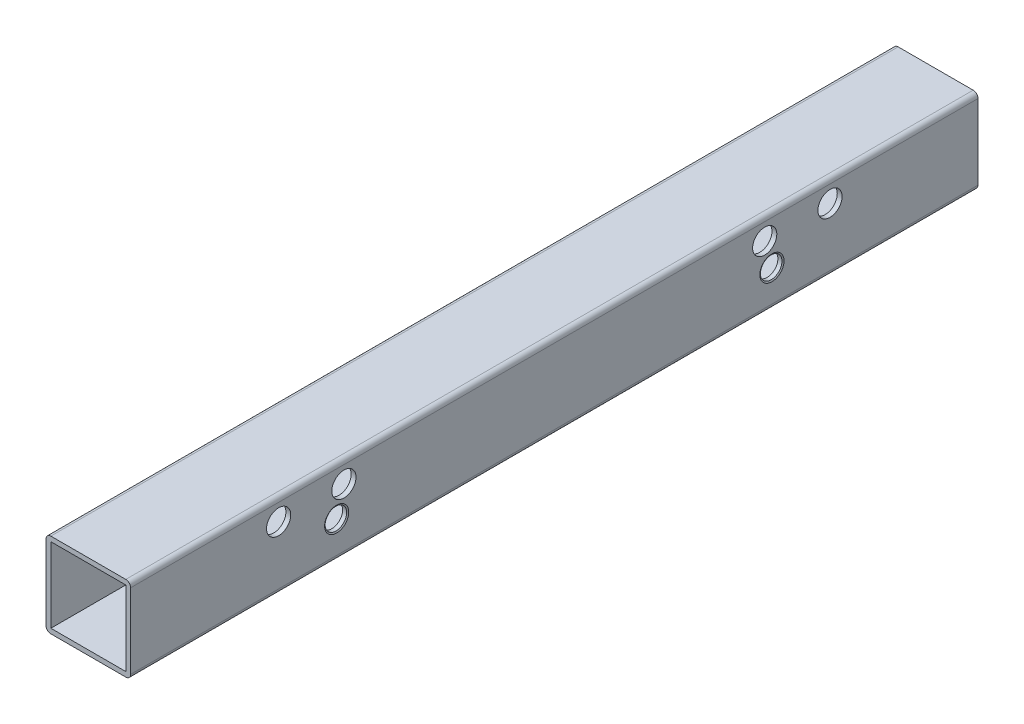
ISO-10303-21;
HEADER;
FILE_DESCRIPTION(('STEP AP214'),'2;1');
FILE_NAME('part.step','',(''),(''),'','','');
FILE_SCHEMA(('AUTOMOTIVE_DESIGN { 1 0 10303 214 1 1 1 1 }'));
ENDSEC;
DATA;
#1=APPLICATION_CONTEXT('core data for automotive mechanical design processes');
#2=APPLICATION_PROTOCOL_DEFINITION('international standard','automotive_design',2000,#1);
#3=PRODUCT_CONTEXT('',#1,'mechanical');
#4=PRODUCT('Part','Part','',(#3));
#5=PRODUCT_RELATED_PRODUCT_CATEGORY('part','',(#4));
#6=PRODUCT_DEFINITION_FORMATION('','',#4);
#7=PRODUCT_DEFINITION_CONTEXT('part definition',#1,'design');
#8=PRODUCT_DEFINITION('design','',#6,#7);
#9=PRODUCT_DEFINITION_SHAPE('','',#8);
#10=(LENGTH_UNIT() NAMED_UNIT(*) SI_UNIT(.MILLI.,.METRE.));
#11=(NAMED_UNIT(*) PLANE_ANGLE_UNIT() SI_UNIT($,.RADIAN.));
#12=(NAMED_UNIT(*) SI_UNIT($,.STERADIAN.) SOLID_ANGLE_UNIT());
#13=UNCERTAINTY_MEASURE_WITH_UNIT(LENGTH_MEASURE(1.E-05),#10,'distance_accuracy_value','');
#14=(GEOMETRIC_REPRESENTATION_CONTEXT(3) GLOBAL_UNCERTAINTY_ASSIGNED_CONTEXT((#13)) GLOBAL_UNIT_ASSIGNED_CONTEXT((#10,
#11,#12)) REPRESENTATION_CONTEXT('',''));
#15=CARTESIAN_POINT('',(0.,0.,0.));
#16=DIRECTION('',(0.,0.,1.));
#17=DIRECTION('',(1.,0.,0.));
#18=AXIS2_PLACEMENT_3D('',#15,#16,#17);
#19=CARTESIAN_POINT('',(-17.5,15.5,210.2));
#20=DIRECTION('',(1.,0.,0.));
#21=DIRECTION('',(0.,0.,-1.));
#22=AXIS2_PLACEMENT_3D('',#19,#20,#21);
#23=PLANE('',#22);
#24=CARTESIAN_POINT('',(-17.5,8.53999999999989,-114.));
#25=DIRECTION('',(-1.,0.,0.));
#26=DIRECTION('',(0.,0.,1.));
#27=AXIS2_PLACEMENT_3D('',#24,#25,#26);
#28=CIRCLE('',#27,3.00000000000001);
#29=CARTESIAN_POINT('',(-17.5,8.53999999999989,-111.));
#30=VERTEX_POINT('',#29);
#31=EDGE_CURVE('E187',#30,#30,#28,.T.);
#32=ORIENTED_EDGE('',*,*,#31,.F.);
#33=EDGE_LOOP('',(#32));
#34=FACE_BOUND('',#33,.T.);
#35=CARTESIAN_POINT('',(-17.5,8.53999999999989,-87.));
#36=DIRECTION('',(-1.,0.,0.));
#37=DIRECTION('',(0.,0.,1.));
#38=AXIS2_PLACEMENT_3D('',#35,#36,#37);
#39=CIRCLE('',#38,3.00000000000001);
#40=CARTESIAN_POINT('',(-17.5,8.53999999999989,-84.));
#41=VERTEX_POINT('',#40);
#42=EDGE_CURVE('E193',#41,#41,#39,.T.);
#43=ORIENTED_EDGE('',*,*,#42,.F.);
#44=EDGE_LOOP('',(#43));
#45=FACE_BOUND('',#44,.T.);
#46=CARTESIAN_POINT('',(-17.5,8.53999999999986,114.));
#47=DIRECTION('',(-1.,0.,0.));
#48=DIRECTION('',(0.,0.,1.));
#49=AXIS2_PLACEMENT_3D('',#46,#47,#48);
#50=CIRCLE('',#49,3.00000000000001);
#51=CARTESIAN_POINT('',(-17.5,8.53999999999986,117.));
#52=VERTEX_POINT('',#51);
#53=EDGE_CURVE('E199',#52,#52,#50,.T.);
#54=ORIENTED_EDGE('',*,*,#53,.F.);
#55=EDGE_LOOP('',(#54));
#56=FACE_BOUND('',#55,.T.);
#57=CARTESIAN_POINT('',(-17.5,8.53999999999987,87.));
#58=DIRECTION('',(-1.,0.,0.));
#59=DIRECTION('',(0.,0.,1.));
#60=AXIS2_PLACEMENT_3D('',#57,#58,#59);
#61=CIRCLE('',#60,3.00000000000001);
#62=CARTESIAN_POINT('',(-17.5,8.53999999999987,90.));
#63=VERTEX_POINT('',#62);
#64=EDGE_CURVE('E205',#63,#63,#61,.T.);
#65=ORIENTED_EDGE('',*,*,#64,.F.);
#66=EDGE_LOOP('',(#65));
#67=FACE_BOUND('',#66,.T.);
#68=DIRECTION('',(0.,0.,-1.));
#69=VECTOR('',#68,1.);
#70=CARTESIAN_POINT('',(-17.5,-15.5,210.2));
#71=LINE('',#70,#69);
#72=CARTESIAN_POINT('',(-17.5,-15.5,175.2));
#73=VERTEX_POINT('',#72);
#74=CARTESIAN_POINT('',(-17.5,-15.5,-175.2));
#75=VERTEX_POINT('',#74);
#76=EDGE_CURVE('E130',#73,#75,#71,.T.);
#77=ORIENTED_EDGE('',*,*,#76,.F.);
#78=DIRECTION('',(0.,1.,0.));
#79=VECTOR('',#78,1.);
#80=CARTESIAN_POINT('',(-17.5,17.4999999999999,175.2));
#81=LINE('',#80,#79);
#82=CARTESIAN_POINT('',(-17.5,15.5,175.2));
#83=VERTEX_POINT('',#82);
#84=EDGE_CURVE('E115',#73,#83,#81,.T.);
#85=ORIENTED_EDGE('',*,*,#84,.T.);
#86=DIRECTION('',(0.,0.,-1.));
#87=VECTOR('',#86,1.);
#88=CARTESIAN_POINT('',(-17.5,15.5,210.2));
#89=LINE('',#88,#87);
#90=CARTESIAN_POINT('',(-17.5,15.5,-175.2));
#91=VERTEX_POINT('',#90);
#92=EDGE_CURVE('E138',#83,#91,#89,.T.);
#93=ORIENTED_EDGE('',*,*,#92,.T.);
#94=DIRECTION('',(0.,-1.,0.));
#95=VECTOR('',#94,1.);
#96=CARTESIAN_POINT('',(-17.5,17.5,-175.2));
#97=LINE('',#96,#95);
#98=EDGE_CURVE('E137',#91,#75,#97,.T.);
#99=ORIENTED_EDGE('',*,*,#98,.T.);
#100=EDGE_LOOP('',(#77,#85,#93,#99));
#101=FACE_BOUND('',#100,.T.);
#102=ADVANCED_FACE('F28',(#34,#45,#56,#67,#101),#23,.F.);
#103=CARTESIAN_POINT('',(17.5,-15.5,210.2));
#104=DIRECTION('',(-1.,0.,0.));
#105=DIRECTION('',(0.,0.,1.));
#106=AXIS2_PLACEMENT_3D('',#103,#104,#105);
#107=PLANE('',#106);
#108=CARTESIAN_POINT('',(17.5,-2.50000000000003,90.));
#109=DIRECTION('',(-1.,0.,0.));
#110=DIRECTION('',(0.,0.,1.));
#111=AXIS2_PLACEMENT_3D('',#108,#109,#110);
#112=CIRCLE('',#111,4.99999999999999);
#113=CARTESIAN_POINT('',(17.5,-2.50000000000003,95.));
#114=VERTEX_POINT('',#113);
#115=EDGE_CURVE('E36',#114,#114,#112,.T.);
#116=ORIENTED_EDGE('',*,*,#115,.T.);
#117=EDGE_LOOP('',(#116));
#118=FACE_BOUND('',#117,.T.);
#119=CARTESIAN_POINT('',(17.5,-2.50000000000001,-90.));
#120=DIRECTION('',(-1.,0.,0.));
#121=DIRECTION('',(0.,0.,1.));
#122=AXIS2_PLACEMENT_3D('',#119,#120,#121);
#123=CIRCLE('',#122,4.99999999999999);
#124=CARTESIAN_POINT('',(17.5,-2.50000000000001,-85.));
#125=VERTEX_POINT('',#124);
#126=EDGE_CURVE('E157',#125,#125,#123,.T.);
#127=ORIENTED_EDGE('',*,*,#126,.T.);
#128=EDGE_LOOP('',(#127));
#129=FACE_BOUND('',#128,.T.);
#130=CARTESIAN_POINT('',(17.5,8.53999999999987,87.));
#131=DIRECTION('',(1.,0.,0.));
#132=DIRECTION('',(0.,0.,1.));
#133=AXIS2_PLACEMENT_3D('',#130,#131,#132);
#134=CIRCLE('',#133,5.);
#135=CARTESIAN_POINT('',(17.5,8.53999999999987,92.));
#136=VERTEX_POINT('',#135);
#137=EDGE_CURVE('E208',#136,#136,#134,.T.);
#138=ORIENTED_EDGE('',*,*,#137,.F.);
#139=EDGE_LOOP('',(#138));
#140=FACE_BOUND('',#139,.T.);
#141=CARTESIAN_POINT('',(17.5,8.53999999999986,114.));
#142=DIRECTION('',(1.,0.,0.));
#143=DIRECTION('',(0.,0.,1.));
#144=AXIS2_PLACEMENT_3D('',#141,#142,#143);
#145=CIRCLE('',#144,5.);
#146=CARTESIAN_POINT('',(17.5,8.53999999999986,119.));
#147=VERTEX_POINT('',#146);
#148=EDGE_CURVE('E216',#147,#147,#145,.T.);
#149=ORIENTED_EDGE('',*,*,#148,.F.);
#150=EDGE_LOOP('',(#149));
#151=FACE_BOUND('',#150,.T.);
#152=CARTESIAN_POINT('',(17.5,8.53999999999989,-114.));
#153=DIRECTION('',(1.,0.,0.));
#154=DIRECTION('',(0.,0.,-1.));
#155=AXIS2_PLACEMENT_3D('',#152,#153,#154);
#156=CIRCLE('',#155,5.);
#157=CARTESIAN_POINT('',(17.5,8.53999999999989,-119.));
#158=VERTEX_POINT('',#157);
#159=EDGE_CURVE('E222',#158,#158,#156,.T.);
#160=ORIENTED_EDGE('',*,*,#159,.F.);
#161=EDGE_LOOP('',(#160));
#162=FACE_BOUND('',#161,.T.);
#163=CARTESIAN_POINT('',(17.5,8.53999999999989,-87.));
#164=DIRECTION('',(1.,0.,0.));
#165=DIRECTION('',(0.,0.,-1.));
#166=AXIS2_PLACEMENT_3D('',#163,#164,#165);
#167=CIRCLE('',#166,5.);
#168=CARTESIAN_POINT('',(17.5,8.53999999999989,-92.));
#169=VERTEX_POINT('',#168);
#170=EDGE_CURVE('E228',#169,#169,#167,.T.);
#171=ORIENTED_EDGE('',*,*,#170,.F.);
#172=EDGE_LOOP('',(#171));
#173=FACE_BOUND('',#172,.T.);
#174=DIRECTION('',(0.,0.,-1.));
#175=VECTOR('',#174,1.);
#176=CARTESIAN_POINT('',(17.5,15.5,210.2));
#177=LINE('',#176,#175);
#178=CARTESIAN_POINT('',(17.5,15.5,175.2));
#179=VERTEX_POINT('',#178);
#180=CARTESIAN_POINT('',(17.5,15.5,-175.2));
#181=VERTEX_POINT('',#180);
#182=EDGE_CURVE('E283',#179,#181,#177,.T.);
#183=ORIENTED_EDGE('',*,*,#182,.F.);
#184=DIRECTION('',(0.,1.,0.));
#185=VECTOR('',#184,1.);
#186=CARTESIAN_POINT('',(17.5,17.4999999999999,175.2));
#187=LINE('',#186,#185);
#188=CARTESIAN_POINT('',(17.5,-15.5,175.2));
#189=VERTEX_POINT('',#188);
#190=EDGE_CURVE('E124',#189,#179,#187,.T.);
#191=ORIENTED_EDGE('',*,*,#190,.F.);
#192=DIRECTION('',(0.,0.,-1.));
#193=VECTOR('',#192,1.);
#194=CARTESIAN_POINT('',(17.5,-15.5,210.2));
#195=LINE('',#194,#193);
#196=CARTESIAN_POINT('',(17.5,-15.5,-175.2));
#197=VERTEX_POINT('',#196);
#198=EDGE_CURVE('E290',#189,#197,#195,.T.);
#199=ORIENTED_EDGE('',*,*,#198,.T.);
#200=DIRECTION('',(0.,-1.,0.));
#201=VECTOR('',#200,1.);
#202=CARTESIAN_POINT('',(17.5,17.5,-175.2));
#203=LINE('',#202,#201);
#204=EDGE_CURVE('E250',#181,#197,#203,.T.);
#205=ORIENTED_EDGE('',*,*,#204,.F.);
#206=EDGE_LOOP('',(#183,#191,#199,#205));
#207=FACE_BOUND('',#206,.T.);
#208=ADVANCED_FACE('F162',(#118,#129,#140,#151,#162,#173,#207),#107,.F.);
#209=CARTESIAN_POINT('',(-15.5,15.5,210.2));
#210=DIRECTION('',(1.,0.,0.));
#211=DIRECTION('',(0.,0.,-1.));
#212=AXIS2_PLACEMENT_3D('',#209,#210,#211);
#213=PLANE('',#212);
#214=CARTESIAN_POINT('',(-15.5,8.53999999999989,-114.));
#215=DIRECTION('',(1.,0.,0.));
#216=DIRECTION('',(0.,0.,-1.));
#217=AXIS2_PLACEMENT_3D('',#214,#215,#216);
#218=CIRCLE('',#217,3.00000000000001);
#219=CARTESIAN_POINT('',(-15.5,8.53999999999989,-117.));
#220=VERTEX_POINT('',#219);
#221=EDGE_CURVE('E184',#220,#220,#218,.F.);
#222=ORIENTED_EDGE('',*,*,#221,.T.);
#223=EDGE_LOOP('',(#222));
#224=FACE_BOUND('',#223,.T.);
#225=CARTESIAN_POINT('',(-15.5,8.53999999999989,-87.));
#226=DIRECTION('',(1.,0.,0.));
#227=DIRECTION('',(0.,0.,-1.));
#228=AXIS2_PLACEMENT_3D('',#225,#226,#227);
#229=CIRCLE('',#228,3.00000000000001);
#230=CARTESIAN_POINT('',(-15.5,8.53999999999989,-90.));
#231=VERTEX_POINT('',#230);
#232=EDGE_CURVE('E190',#231,#231,#229,.F.);
#233=ORIENTED_EDGE('',*,*,#232,.T.);
#234=EDGE_LOOP('',(#233));
#235=FACE_BOUND('',#234,.T.);
#236=CARTESIAN_POINT('',(-15.5,8.53999999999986,114.));
#237=DIRECTION('',(1.,0.,0.));
#238=DIRECTION('',(0.,0.,-1.));
#239=AXIS2_PLACEMENT_3D('',#236,#237,#238);
#240=CIRCLE('',#239,3.00000000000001);
#241=CARTESIAN_POINT('',(-15.5,8.53999999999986,111.));
#242=VERTEX_POINT('',#241);
#243=EDGE_CURVE('E196',#242,#242,#240,.F.);
#244=ORIENTED_EDGE('',*,*,#243,.T.);
#245=EDGE_LOOP('',(#244));
#246=FACE_BOUND('',#245,.T.);
#247=CARTESIAN_POINT('',(-15.5,8.53999999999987,87.));
#248=DIRECTION('',(1.,0.,0.));
#249=DIRECTION('',(0.,0.,-1.));
#250=AXIS2_PLACEMENT_3D('',#247,#248,#249);
#251=CIRCLE('',#250,3.00000000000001);
#252=CARTESIAN_POINT('',(-15.5,8.53999999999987,84.));
#253=VERTEX_POINT('',#252);
#254=EDGE_CURVE('E202',#253,#253,#251,.F.);
#255=ORIENTED_EDGE('',*,*,#254,.T.);
#256=EDGE_LOOP('',(#255));
#257=FACE_BOUND('',#256,.T.);
#258=DIRECTION('',(0.,1.,0.));
#259=VECTOR('',#258,1.);
#260=CARTESIAN_POINT('',(-15.5,15.5,175.2));
#261=LINE('',#260,#259);
#262=CARTESIAN_POINT('',(-15.5,-15.5,175.2));
#263=VERTEX_POINT('',#262);
#264=CARTESIAN_POINT('',(-15.5,15.5,175.2));
#265=VERTEX_POINT('',#264);
#266=EDGE_CURVE('E240',#263,#265,#261,.T.);
#267=ORIENTED_EDGE('',*,*,#266,.F.);
#268=DIRECTION('',(0.,0.,-1.));
#269=VECTOR('',#268,1.);
#270=CARTESIAN_POINT('',(-15.5,-15.5,210.2));
#271=LINE('',#270,#269);
#272=CARTESIAN_POINT('',(-15.5,-15.5,-175.2));
#273=VERTEX_POINT('',#272);
#274=EDGE_CURVE('E284',#263,#273,#271,.T.);
#275=ORIENTED_EDGE('',*,*,#274,.T.);
#276=DIRECTION('',(0.,-1.,0.));
#277=VECTOR('',#276,1.);
#278=CARTESIAN_POINT('',(-15.5,15.5,-175.2));
#279=LINE('',#278,#277);
#280=CARTESIAN_POINT('',(-15.5,15.5,-175.2));
#281=VERTEX_POINT('',#280);
#282=EDGE_CURVE('E263',#281,#273,#279,.T.);
#283=ORIENTED_EDGE('',*,*,#282,.F.);
#284=DIRECTION('',(0.,0.,-1.));
#285=VECTOR('',#284,1.);
#286=CARTESIAN_POINT('',(-15.5,15.5,210.2));
#287=LINE('',#286,#285);
#288=EDGE_CURVE('E281',#265,#281,#287,.T.);
#289=ORIENTED_EDGE('',*,*,#288,.F.);
#290=EDGE_LOOP('',(#267,#275,#283,#289));
#291=FACE_BOUND('',#290,.T.);
#292=ADVANCED_FACE('F319',(#224,#235,#246,#257,#291),#213,.T.);
#293=CARTESIAN_POINT('',(15.5,-15.5,210.2));
#294=DIRECTION('',(-1.,0.,0.));
#295=DIRECTION('',(0.,0.,1.));
#296=AXIS2_PLACEMENT_3D('',#293,#294,#295);
#297=PLANE('',#296);
#298=CARTESIAN_POINT('',(15.5,-2.50000000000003,90.));
#299=DIRECTION('',(-1.,0.,0.));
#300=DIRECTION('',(0.,0.,1.));
#301=AXIS2_PLACEMENT_3D('',#298,#299,#300);
#302=CIRCLE('',#301,4.44999999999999);
#303=CARTESIAN_POINT('',(15.5,-2.50000000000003,94.45));
#304=VERTEX_POINT('',#303);
#305=EDGE_CURVE('E179',#304,#304,#302,.F.);
#306=ORIENTED_EDGE('',*,*,#305,.T.);
#307=EDGE_LOOP('',(#306));
#308=FACE_BOUND('',#307,.T.);
#309=CARTESIAN_POINT('',(15.5,-2.50000000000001,-90.));
#310=DIRECTION('',(-1.,0.,0.));
#311=DIRECTION('',(0.,0.,1.));
#312=AXIS2_PLACEMENT_3D('',#309,#310,#311);
#313=CIRCLE('',#312,4.44999999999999);
#314=CARTESIAN_POINT('',(15.5,-2.50000000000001,-85.55));
#315=VERTEX_POINT('',#314);
#316=EDGE_CURVE('E181',#315,#315,#313,.F.);
#317=ORIENTED_EDGE('',*,*,#316,.T.);
#318=EDGE_LOOP('',(#317));
#319=FACE_BOUND('',#318,.T.);
#320=CARTESIAN_POINT('',(15.5,8.53999999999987,87.));
#321=DIRECTION('',(-1.,0.,0.));
#322=DIRECTION('',(0.,0.,1.));
#323=AXIS2_PLACEMENT_3D('',#320,#321,#322);
#324=CIRCLE('',#323,5.);
#325=CARTESIAN_POINT('',(15.5,8.53999999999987,92.));
#326=VERTEX_POINT('',#325);
#327=EDGE_CURVE('E213',#326,#326,#324,.F.);
#328=ORIENTED_EDGE('',*,*,#327,.T.);
#329=EDGE_LOOP('',(#328));
#330=FACE_BOUND('',#329,.T.);
#331=CARTESIAN_POINT('',(15.5,8.53999999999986,114.));
#332=DIRECTION('',(-1.,0.,0.));
#333=DIRECTION('',(0.,0.,1.));
#334=AXIS2_PLACEMENT_3D('',#331,#332,#333);
#335=CIRCLE('',#334,5.);
#336=CARTESIAN_POINT('',(15.5,8.53999999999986,119.));
#337=VERTEX_POINT('',#336);
#338=EDGE_CURVE('E219',#337,#337,#335,.F.);
#339=ORIENTED_EDGE('',*,*,#338,.T.);
#340=EDGE_LOOP('',(#339));
#341=FACE_BOUND('',#340,.T.);
#342=CARTESIAN_POINT('',(15.5,8.53999999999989,-114.));
#343=DIRECTION('',(-1.,0.,0.));
#344=DIRECTION('',(0.,0.,1.));
#345=AXIS2_PLACEMENT_3D('',#342,#343,#344);
#346=CIRCLE('',#345,5.);
#347=CARTESIAN_POINT('',(15.5,8.53999999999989,-109.));
#348=VERTEX_POINT('',#347);
#349=EDGE_CURVE('E225',#348,#348,#346,.F.);
#350=ORIENTED_EDGE('',*,*,#349,.T.);
#351=EDGE_LOOP('',(#350));
#352=FACE_BOUND('',#351,.T.);
#353=CARTESIAN_POINT('',(15.5,8.53999999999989,-87.));
#354=DIRECTION('',(-1.,0.,0.));
#355=DIRECTION('',(0.,0.,1.));
#356=AXIS2_PLACEMENT_3D('',#353,#354,#355);
#357=CIRCLE('',#356,5.);
#358=CARTESIAN_POINT('',(15.5,8.53999999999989,-82.));
#359=VERTEX_POINT('',#358);
#360=EDGE_CURVE('E231',#359,#359,#357,.F.);
#361=ORIENTED_EDGE('',*,*,#360,.T.);
#362=EDGE_LOOP('',(#361));
#363=FACE_BOUND('',#362,.T.);
#364=DIRECTION('',(0.,-1.,0.));
#365=VECTOR('',#364,1.);
#366=CARTESIAN_POINT('',(15.5,-15.4999999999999,175.2));
#367=LINE('',#366,#365);
#368=CARTESIAN_POINT('',(15.5,15.5,175.2));
#369=VERTEX_POINT('',#368);
#370=CARTESIAN_POINT('',(15.5,-15.5,175.2));
#371=VERTEX_POINT('',#370);
#372=EDGE_CURVE('E51',#369,#371,#367,.T.);
#373=ORIENTED_EDGE('',*,*,#372,.F.);
#374=DIRECTION('',(0.,0.,-1.));
#375=VECTOR('',#374,1.);
#376=CARTESIAN_POINT('',(15.5,15.5,210.2));
#377=LINE('',#376,#375);
#378=CARTESIAN_POINT('',(15.5,15.5,-175.2));
#379=VERTEX_POINT('',#378);
#380=EDGE_CURVE('E280',#369,#379,#377,.T.);
#381=ORIENTED_EDGE('',*,*,#380,.T.);
#382=DIRECTION('',(0.,1.,0.));
#383=VECTOR('',#382,1.);
#384=CARTESIAN_POINT('',(15.5,-15.5,-175.2));
#385=LINE('',#384,#383);
#386=CARTESIAN_POINT('',(15.5,-15.5,-175.2));
#387=VERTEX_POINT('',#386);
#388=EDGE_CURVE('E258',#387,#379,#385,.T.);
#389=ORIENTED_EDGE('',*,*,#388,.F.);
#390=DIRECTION('',(0.,0.,-1.));
#391=VECTOR('',#390,1.);
#392=CARTESIAN_POINT('',(15.5,-15.5,210.2));
#393=LINE('',#392,#391);
#394=EDGE_CURVE('E286',#371,#387,#393,.T.);
#395=ORIENTED_EDGE('',*,*,#394,.F.);
#396=EDGE_LOOP('',(#373,#381,#389,#395));
#397=FACE_BOUND('',#396,.T.);
#398=ADVANCED_FACE('F332',(#308,#319,#330,#341,#352,#363,#397),#297,.T.);
#399=CARTESIAN_POINT('',(15.5,15.5,210.2));
#400=DIRECTION('',(0.,0.,-1.));
#401=DIRECTION('',(-1.,0.,0.));
#402=AXIS2_PLACEMENT_3D('',#399,#400,#401);
#403=CYLINDRICAL_SURFACE('',#402,2.);
#404=DIRECTION('',(0.,0.,-1.));
#405=VECTOR('',#404,1.);
#406=CARTESIAN_POINT('',(15.5,17.5,210.2));
#407=LINE('',#406,#405);
#408=CARTESIAN_POINT('',(15.5,17.4999999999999,175.2));
#409=VERTEX_POINT('',#408);
#410=CARTESIAN_POINT('',(15.5,17.5,-175.2));
#411=VERTEX_POINT('',#410);
#412=EDGE_CURVE('E147',#409,#411,#407,.T.);
#413=ORIENTED_EDGE('',*,*,#412,.F.);
#414=CARTESIAN_POINT('',(15.5,15.5,175.2));
#415=DIRECTION('',(0.,0.,-1.));
#416=DIRECTION('',(0.,1.,0.));
#417=AXIS2_PLACEMENT_3D('',#414,#415,#416);
#418=CIRCLE('',#417,2.);
#419=EDGE_CURVE('E247',#409,#179,#418,.T.);
#420=ORIENTED_EDGE('',*,*,#419,.T.);
#421=ORIENTED_EDGE('',*,*,#182,.T.);
#422=CARTESIAN_POINT('',(15.5,15.5,-175.2));
#423=DIRECTION('',(0.,0.,1.));
#424=DIRECTION('',(1.,0.,0.));
#425=AXIS2_PLACEMENT_3D('',#422,#423,#424);
#426=CIRCLE('',#425,2.);
#427=EDGE_CURVE('E277',#181,#411,#426,.T.);
#428=ORIENTED_EDGE('',*,*,#427,.T.);
#429=EDGE_LOOP('',(#413,#420,#421,#428));
#430=FACE_BOUND('',#429,.T.);
#431=ADVANCED_FACE('F30',(#430),#403,.T.);
#432=CARTESIAN_POINT('',(-15.5,17.5,210.2));
#433=DIRECTION('',(0.,1.,0.));
#434=DIRECTION('',(0.,0.,1.));
#435=AXIS2_PLACEMENT_3D('',#432,#433,#434);
#436=PLANE('',#435);
#437=DIRECTION('',(1.,0.,0.));
#438=VECTOR('',#437,1.);
#439=CARTESIAN_POINT('',(-17.5,17.4999999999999,175.2));
#440=LINE('',#439,#438);
#441=CARTESIAN_POINT('',(-15.5,17.4999999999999,175.2));
#442=VERTEX_POINT('',#441);
#443=EDGE_CURVE('E235',#442,#409,#440,.T.);
#444=ORIENTED_EDGE('',*,*,#443,.T.);
#445=ORIENTED_EDGE('',*,*,#412,.T.);
#446=DIRECTION('',(1.,0.,0.));
#447=VECTOR('',#446,1.);
#448=CARTESIAN_POINT('',(-17.5,17.5,-175.2));
#449=LINE('',#448,#447);
#450=CARTESIAN_POINT('',(-15.5,17.5,-175.2));
#451=VERTEX_POINT('',#450);
#452=EDGE_CURVE('E255',#451,#411,#449,.T.);
#453=ORIENTED_EDGE('',*,*,#452,.F.);
#454=DIRECTION('',(0.,0.,-1.));
#455=VECTOR('',#454,1.);
#456=CARTESIAN_POINT('',(-15.5,17.5,210.2));
#457=LINE('',#456,#455);
#458=EDGE_CURVE('E140',#442,#451,#457,.T.);
#459=ORIENTED_EDGE('',*,*,#458,.F.);
#460=EDGE_LOOP('',(#444,#445,#453,#459));
#461=FACE_BOUND('',#460,.T.);
#462=ADVANCED_FACE('F325',(#461),#436,.T.);
#463=CARTESIAN_POINT('',(-15.5,15.5,210.2));
#464=DIRECTION('',(0.,0.,-1.));
#465=DIRECTION('',(-1.,0.,0.));
#466=AXIS2_PLACEMENT_3D('',#463,#464,#465);
#467=CYLINDRICAL_SURFACE('',#466,2.);
#468=ORIENTED_EDGE('',*,*,#92,.F.);
#469=CARTESIAN_POINT('',(-15.5,15.5,175.2));
#470=DIRECTION('',(0.,0.,-1.));
#471=DIRECTION('',(0.,1.,0.));
#472=AXIS2_PLACEMENT_3D('',#469,#470,#471);
#473=CIRCLE('',#472,2.);
#474=EDGE_CURVE('E120',#83,#442,#473,.T.);
#475=ORIENTED_EDGE('',*,*,#474,.T.);
#476=ORIENTED_EDGE('',*,*,#458,.T.);
#477=CARTESIAN_POINT('',(-15.5,15.5,-175.2));
#478=DIRECTION('',(0.,0.,1.));
#479=DIRECTION('',(1.,0.,0.));
#480=AXIS2_PLACEMENT_3D('',#477,#478,#479);
#481=CIRCLE('',#480,2.);
#482=EDGE_CURVE('E274',#451,#91,#481,.T.);
#483=ORIENTED_EDGE('',*,*,#482,.T.);
#484=EDGE_LOOP('',(#468,#475,#476,#483));
#485=FACE_BOUND('',#484,.T.);
#486=ADVANCED_FACE('F311',(#485),#467,.T.);
#487=CARTESIAN_POINT('',(-15.5,-15.5,210.2));
#488=DIRECTION('',(0.,0.,-1.));
#489=DIRECTION('',(-1.,0.,0.));
#490=AXIS2_PLACEMENT_3D('',#487,#488,#489);
#491=CYLINDRICAL_SURFACE('',#490,2.);
#492=CARTESIAN_POINT('',(-15.5,-15.5,175.2));
#493=DIRECTION('',(0.,0.,-1.));
#494=DIRECTION('',(0.,1.,0.));
#495=AXIS2_PLACEMENT_3D('',#492,#493,#494);
#496=CIRCLE('',#495,2.);
#497=CARTESIAN_POINT('',(-15.5,-17.5000000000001,175.2));
#498=VERTEX_POINT('',#497);
#499=EDGE_CURVE('E118',#73,#498,#496,.F.);
#500=ORIENTED_EDGE('',*,*,#499,.F.);
#501=ORIENTED_EDGE('',*,*,#76,.T.);
#502=CARTESIAN_POINT('',(-15.5,-15.5,-175.2));
#503=DIRECTION('',(0.,0.,1.));
#504=DIRECTION('',(1.,0.,0.));
#505=AXIS2_PLACEMENT_3D('',#502,#503,#504);
#506=CIRCLE('',#505,2.);
#507=CARTESIAN_POINT('',(-15.5,-17.5,-175.2));
#508=VERTEX_POINT('',#507);
#509=EDGE_CURVE('E272',#508,#75,#506,.F.);
#510=ORIENTED_EDGE('',*,*,#509,.F.);
#511=DIRECTION('',(0.,0.,-1.));
#512=VECTOR('',#511,1.);
#513=CARTESIAN_POINT('',(-15.5,-17.5,210.2));
#514=LINE('',#513,#512);
#515=EDGE_CURVE('E132',#498,#508,#514,.T.);
#516=ORIENTED_EDGE('',*,*,#515,.F.);
#517=EDGE_LOOP('',(#500,#501,#510,#516));
#518=FACE_BOUND('',#517,.T.);
#519=ADVANCED_FACE('F128',(#518),#491,.T.);
#520=CARTESIAN_POINT('',(15.5,-17.5,210.2));
#521=DIRECTION('',(0.,-1.,0.));
#522=DIRECTION('',(1.,0.,0.));
#523=AXIS2_PLACEMENT_3D('',#520,#521,#522);
#524=PLANE('',#523);
#525=DIRECTION('',(1.,0.,0.));
#526=VECTOR('',#525,1.);
#527=CARTESIAN_POINT('',(-17.5,-17.5000000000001,175.2));
#528=LINE('',#527,#526);
#529=CARTESIAN_POINT('',(15.5,-17.5,175.2));
#530=VERTEX_POINT('',#529);
#531=EDGE_CURVE('E43',#498,#530,#528,.T.);
#532=ORIENTED_EDGE('',*,*,#531,.F.);
#533=ORIENTED_EDGE('',*,*,#515,.T.);
#534=DIRECTION('',(1.,0.,0.));
#535=VECTOR('',#534,1.);
#536=CARTESIAN_POINT('',(-17.5,-17.5,-175.2));
#537=LINE('',#536,#535);
#538=CARTESIAN_POINT('',(15.5,-17.5,-175.2));
#539=VERTEX_POINT('',#538);
#540=EDGE_CURVE('E254',#508,#539,#537,.T.);
#541=ORIENTED_EDGE('',*,*,#540,.T.);
#542=DIRECTION('',(0.,0.,-1.));
#543=VECTOR('',#542,1.);
#544=CARTESIAN_POINT('',(15.5,-17.5,210.2));
#545=LINE('',#544,#543);
#546=EDGE_CURVE('E142',#530,#539,#545,.T.);
#547=ORIENTED_EDGE('',*,*,#546,.F.);
#548=EDGE_LOOP('',(#532,#533,#541,#547));
#549=FACE_BOUND('',#548,.T.);
#550=ADVANCED_FACE('F302',(#549),#524,.T.);
#551=CARTESIAN_POINT('',(15.5,-15.5,210.2));
#552=DIRECTION('',(0.,0.,-1.));
#553=DIRECTION('',(-1.,0.,0.));
#554=AXIS2_PLACEMENT_3D('',#551,#552,#553);
#555=CYLINDRICAL_SURFACE('',#554,2.);
#556=CARTESIAN_POINT('',(15.5,-15.5,175.2));
#557=DIRECTION('',(0.,0.,-1.));
#558=DIRECTION('',(0.,1.,0.));
#559=AXIS2_PLACEMENT_3D('',#556,#557,#558);
#560=CIRCLE('',#559,2.);
#561=EDGE_CURVE('E133',#530,#189,#560,.F.);
#562=ORIENTED_EDGE('',*,*,#561,.F.);
#563=ORIENTED_EDGE('',*,*,#546,.T.);
#564=CARTESIAN_POINT('',(15.5,-15.5,-175.2));
#565=DIRECTION('',(0.,0.,1.));
#566=DIRECTION('',(1.,0.,0.));
#567=AXIS2_PLACEMENT_3D('',#564,#565,#566);
#568=CIRCLE('',#567,2.);
#569=EDGE_CURVE('E269',#197,#539,#568,.F.);
#570=ORIENTED_EDGE('',*,*,#569,.F.);
#571=ORIENTED_EDGE('',*,*,#198,.F.);
#572=EDGE_LOOP('',(#562,#563,#570,#571));
#573=FACE_BOUND('',#572,.T.);
#574=ADVANCED_FACE('F294',(#573),#555,.T.);
#575=CARTESIAN_POINT('',(-15.5,15.5,210.2));
#576=DIRECTION('',(0.,1.,0.));
#577=DIRECTION('',(0.,0.,1.));
#578=AXIS2_PLACEMENT_3D('',#575,#576,#577);
#579=PLANE('',#578);
#580=ORIENTED_EDGE('',*,*,#380,.F.);
#581=DIRECTION('',(-1.,0.,0.));
#582=VECTOR('',#581,1.);
#583=CARTESIAN_POINT('',(-15.5,15.5,175.2));
#584=LINE('',#583,#582);
#585=EDGE_CURVE('E242',#369,#265,#584,.T.);
#586=ORIENTED_EDGE('',*,*,#585,.T.);
#587=ORIENTED_EDGE('',*,*,#288,.T.);
#588=DIRECTION('',(1.,0.,0.));
#589=VECTOR('',#588,1.);
#590=CARTESIAN_POINT('',(-15.5,15.5,-175.2));
#591=LINE('',#590,#589);
#592=EDGE_CURVE('E266',#281,#379,#591,.T.);
#593=ORIENTED_EDGE('',*,*,#592,.T.);
#594=EDGE_LOOP('',(#580,#586,#587,#593));
#595=FACE_BOUND('',#594,.T.);
#596=ADVANCED_FACE('F309',(#595),#579,.F.);
#597=CARTESIAN_POINT('',(15.5,-15.5,210.2));
#598=DIRECTION('',(0.,-1.,0.));
#599=DIRECTION('',(1.,0.,0.));
#600=AXIS2_PLACEMENT_3D('',#597,#598,#599);
#601=PLANE('',#600);
#602=ORIENTED_EDGE('',*,*,#274,.F.);
#603=DIRECTION('',(1.,0.,0.));
#604=VECTOR('',#603,1.);
#605=CARTESIAN_POINT('',(15.5,-15.5,175.2));
#606=LINE('',#605,#604);
#607=EDGE_CURVE('E152',#263,#371,#606,.T.);
#608=ORIENTED_EDGE('',*,*,#607,.T.);
#609=ORIENTED_EDGE('',*,*,#394,.T.);
#610=DIRECTION('',(-1.,0.,0.));
#611=VECTOR('',#610,1.);
#612=CARTESIAN_POINT('',(15.5,-15.5,-175.2));
#613=LINE('',#612,#611);
#614=EDGE_CURVE('E149',#387,#273,#613,.T.);
#615=ORIENTED_EDGE('',*,*,#614,.T.);
#616=EDGE_LOOP('',(#602,#608,#609,#615));
#617=FACE_BOUND('',#616,.T.);
#618=ADVANCED_FACE('F353',(#617),#601,.F.);
#619=CARTESIAN_POINT('',(-17.5,17.5,-175.2));
#620=DIRECTION('',(0.,0.,1.));
#621=DIRECTION('',(1.,0.,0.));
#622=AXIS2_PLACEMENT_3D('',#619,#620,#621);
#623=PLANE('',#622);
#624=ORIENTED_EDGE('',*,*,#282,.T.);
#625=ORIENTED_EDGE('',*,*,#614,.F.);
#626=ORIENTED_EDGE('',*,*,#388,.T.);
#627=ORIENTED_EDGE('',*,*,#592,.F.);
#628=EDGE_LOOP('',(#624,#625,#626,#627));
#629=FACE_BOUND('',#628,.T.);
#630=ORIENTED_EDGE('',*,*,#204,.T.);
#631=ORIENTED_EDGE('',*,*,#569,.T.);
#632=ORIENTED_EDGE('',*,*,#540,.F.);
#633=ORIENTED_EDGE('',*,*,#509,.T.);
#634=ORIENTED_EDGE('',*,*,#98,.F.);
#635=ORIENTED_EDGE('',*,*,#482,.F.);
#636=ORIENTED_EDGE('',*,*,#452,.T.);
#637=ORIENTED_EDGE('',*,*,#427,.F.);
#638=EDGE_LOOP('',(#630,#631,#632,#633,#634,#635,#636,#637));
#639=FACE_BOUND('',#638,.T.);
#640=ADVANCED_FACE('F299',(#629,#639),#623,.F.);
#641=CARTESIAN_POINT('',(-17.5,17.4999999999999,175.2));
#642=DIRECTION('',(0.,0.,-1.));
#643=DIRECTION('',(0.,1.,0.));
#644=AXIS2_PLACEMENT_3D('',#641,#642,#643);
#645=PLANE('',#644);
#646=ORIENTED_EDGE('',*,*,#372,.T.);
#647=ORIENTED_EDGE('',*,*,#607,.F.);
#648=ORIENTED_EDGE('',*,*,#266,.T.);
#649=ORIENTED_EDGE('',*,*,#585,.F.);
#650=EDGE_LOOP('',(#646,#647,#648,#649));
#651=FACE_BOUND('',#650,.T.);
#652=ORIENTED_EDGE('',*,*,#443,.F.);
#653=ORIENTED_EDGE('',*,*,#474,.F.);
#654=ORIENTED_EDGE('',*,*,#84,.F.);
#655=ORIENTED_EDGE('',*,*,#499,.T.);
#656=ORIENTED_EDGE('',*,*,#531,.T.);
#657=ORIENTED_EDGE('',*,*,#561,.T.);
#658=ORIENTED_EDGE('',*,*,#190,.T.);
#659=ORIENTED_EDGE('',*,*,#419,.F.);
#660=EDGE_LOOP('',(#652,#653,#654,#655,#656,#657,#658,#659));
#661=FACE_BOUND('',#660,.T.);
#662=ADVANCED_FACE('F117',(#651,#661),#645,.F.);
#663=CARTESIAN_POINT('',(1.35786437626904,8.53999999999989,-87.));
#664=DIRECTION('',(1.,0.,0.));
#665=DIRECTION('',(0.,0.,-1.));
#666=AXIS2_PLACEMENT_3D('',#663,#664,#665);
#667=CYLINDRICAL_SURFACE('',#666,5.);
#668=ORIENTED_EDGE('',*,*,#170,.T.);
#669=EDGE_LOOP('',(#668));
#670=FACE_BOUND('',#669,.T.);
#671=ORIENTED_EDGE('',*,*,#360,.F.);
#672=EDGE_LOOP('',(#671));
#673=FACE_BOUND('',#672,.T.);
#674=ADVANCED_FACE('F373',(#670,#673),#667,.F.);
#675=CARTESIAN_POINT('',(1.35786437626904,8.53999999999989,-114.));
#676=DIRECTION('',(1.,0.,0.));
#677=DIRECTION('',(0.,0.,-1.));
#678=AXIS2_PLACEMENT_3D('',#675,#676,#677);
#679=CYLINDRICAL_SURFACE('',#678,5.);
#680=ORIENTED_EDGE('',*,*,#159,.T.);
#681=EDGE_LOOP('',(#680));
#682=FACE_BOUND('',#681,.T.);
#683=ORIENTED_EDGE('',*,*,#349,.F.);
#684=EDGE_LOOP('',(#683));
#685=FACE_BOUND('',#684,.T.);
#686=ADVANCED_FACE('F379',(#682,#685),#679,.F.);
#687=CARTESIAN_POINT('',(1.35786437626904,8.53999999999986,114.));
#688=DIRECTION('',(1.,0.,0.));
#689=DIRECTION('',(0.,0.,-1.));
#690=AXIS2_PLACEMENT_3D('',#687,#688,#689);
#691=CYLINDRICAL_SURFACE('',#690,5.);
#692=ORIENTED_EDGE('',*,*,#148,.T.);
#693=EDGE_LOOP('',(#692));
#694=FACE_BOUND('',#693,.T.);
#695=ORIENTED_EDGE('',*,*,#338,.F.);
#696=EDGE_LOOP('',(#695));
#697=FACE_BOUND('',#696,.T.);
#698=ADVANCED_FACE('F386',(#694,#697),#691,.F.);
#699=CARTESIAN_POINT('',(1.35786437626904,8.53999999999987,87.));
#700=DIRECTION('',(1.,0.,0.));
#701=DIRECTION('',(0.,0.,-1.));
#702=AXIS2_PLACEMENT_3D('',#699,#700,#701);
#703=CYLINDRICAL_SURFACE('',#702,5.);
#704=ORIENTED_EDGE('',*,*,#137,.T.);
#705=EDGE_LOOP('',(#704));
#706=FACE_BOUND('',#705,.T.);
#707=ORIENTED_EDGE('',*,*,#327,.F.);
#708=EDGE_LOOP('',(#707));
#709=FACE_BOUND('',#708,.T.);
#710=ADVANCED_FACE('F390',(#706,#709),#703,.F.);
#711=CARTESIAN_POINT('',(17.501,8.53999999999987,87.));
#712=DIRECTION('',(-1.,0.,0.));
#713=DIRECTION('',(0.,0.,1.));
#714=AXIS2_PLACEMENT_3D('',#711,#712,#713);
#715=CYLINDRICAL_SURFACE('',#714,3.00000000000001);
#716=ORIENTED_EDGE('',*,*,#254,.F.);
#717=EDGE_LOOP('',(#716));
#718=FACE_BOUND('',#717,.T.);
#719=ORIENTED_EDGE('',*,*,#64,.T.);
#720=EDGE_LOOP('',(#719));
#721=FACE_BOUND('',#720,.T.);
#722=ADVANCED_FACE('F394',(#718,#721),#715,.F.);
#723=CARTESIAN_POINT('',(17.501,8.53999999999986,114.));
#724=DIRECTION('',(-1.,0.,0.));
#725=DIRECTION('',(0.,0.,1.));
#726=AXIS2_PLACEMENT_3D('',#723,#724,#725);
#727=CYLINDRICAL_SURFACE('',#726,3.00000000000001);
#728=ORIENTED_EDGE('',*,*,#243,.F.);
#729=EDGE_LOOP('',(#728));
#730=FACE_BOUND('',#729,.T.);
#731=ORIENTED_EDGE('',*,*,#53,.T.);
#732=EDGE_LOOP('',(#731));
#733=FACE_BOUND('',#732,.T.);
#734=ADVANCED_FACE('F398',(#730,#733),#727,.F.);
#735=CARTESIAN_POINT('',(17.501,8.53999999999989,-87.));
#736=DIRECTION('',(-1.,0.,0.));
#737=DIRECTION('',(0.,0.,1.));
#738=AXIS2_PLACEMENT_3D('',#735,#736,#737);
#739=CYLINDRICAL_SURFACE('',#738,3.00000000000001);
#740=ORIENTED_EDGE('',*,*,#232,.F.);
#741=EDGE_LOOP('',(#740));
#742=FACE_BOUND('',#741,.T.);
#743=ORIENTED_EDGE('',*,*,#42,.T.);
#744=EDGE_LOOP('',(#743));
#745=FACE_BOUND('',#744,.T.);
#746=ADVANCED_FACE('F402',(#742,#745),#739,.F.);
#747=CARTESIAN_POINT('',(17.501,8.53999999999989,-114.));
#748=DIRECTION('',(-1.,0.,0.));
#749=DIRECTION('',(0.,0.,1.));
#750=AXIS2_PLACEMENT_3D('',#747,#748,#749);
#751=CYLINDRICAL_SURFACE('',#750,3.00000000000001);
#752=ORIENTED_EDGE('',*,*,#221,.F.);
#753=EDGE_LOOP('',(#752));
#754=FACE_BOUND('',#753,.T.);
#755=ORIENTED_EDGE('',*,*,#31,.T.);
#756=EDGE_LOOP('',(#755));
#757=FACE_BOUND('',#756,.T.);
#758=ADVANCED_FACE('F406',(#754,#757),#751,.F.);
#759=CARTESIAN_POINT('',(-17.501,-2.50000000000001,-90.));
#760=DIRECTION('',(1.,0.,0.));
#761=DIRECTION('',(0.,0.,-1.));
#762=AXIS2_PLACEMENT_3D('',#759,#760,#761);
#763=CYLINDRICAL_SURFACE('',#762,4.44999999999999);
#764=CARTESIAN_POINT('',(17.1824573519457,-2.50000000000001,-90.));
#765=DIRECTION('',(-1.,0.,0.));
#766=DIRECTION('',(0.,0.,1.));
#767=AXIS2_PLACEMENT_3D('',#764,#765,#766);
#768=CIRCLE('',#767,4.44999999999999);
#769=CARTESIAN_POINT('',(17.1824573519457,-2.50000000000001,-85.55));
#770=VERTEX_POINT('',#769);
#771=EDGE_CURVE('E11',#770,#770,#768,.F.);
#772=ORIENTED_EDGE('',*,*,#771,.T.);
#773=EDGE_LOOP('',(#772));
#774=FACE_BOUND('',#773,.T.);
#775=ORIENTED_EDGE('',*,*,#316,.F.);
#776=EDGE_LOOP('',(#775));
#777=FACE_BOUND('',#776,.T.);
#778=ADVANCED_FACE('F175',(#774,#777),#763,.F.);
#779=CARTESIAN_POINT('',(-17.501,-2.50000000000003,90.));
#780=DIRECTION('',(1.,0.,0.));
#781=DIRECTION('',(0.,0.,-1.));
#782=AXIS2_PLACEMENT_3D('',#779,#780,#781);
#783=CYLINDRICAL_SURFACE('',#782,4.44999999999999);
#784=CARTESIAN_POINT('',(17.1824573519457,-2.50000000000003,90.));
#785=DIRECTION('',(-1.,0.,0.));
#786=DIRECTION('',(0.,0.,1.));
#787=AXIS2_PLACEMENT_3D('',#784,#785,#786);
#788=CIRCLE('',#787,4.44999999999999);
#789=CARTESIAN_POINT('',(17.1824573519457,-2.50000000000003,94.45));
#790=VERTEX_POINT('',#789);
#791=EDGE_CURVE('E154',#790,#790,#788,.F.);
#792=ORIENTED_EDGE('',*,*,#791,.T.);
#793=EDGE_LOOP('',(#792));
#794=FACE_BOUND('',#793,.T.);
#795=ORIENTED_EDGE('',*,*,#305,.F.);
#796=EDGE_LOOP('',(#795));
#797=FACE_BOUND('',#796,.T.);
#798=ADVANCED_FACE('F169',(#794,#797),#783,.F.);
#799=CARTESIAN_POINT('',(17.1824573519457,-2.50000000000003,90.));
#800=DIRECTION('',(1.,0.,0.));
#801=DIRECTION('',(0.,0.,-1.));
#802=AXIS2_PLACEMENT_3D('',#799,#800,#801);
#803=CONICAL_SURFACE('',#802,4.44999999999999,1.04719755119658);
#804=ORIENTED_EDGE('',*,*,#115,.F.);
#805=EDGE_LOOP('',(#804));
#806=FACE_BOUND('',#805,.T.);
#807=ORIENTED_EDGE('',*,*,#791,.F.);
#808=EDGE_LOOP('',(#807));
#809=FACE_BOUND('',#808,.T.);
#810=ADVANCED_FACE('F165',(#806,#809),#803,.F.);
#811=CARTESIAN_POINT('',(17.1824573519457,-2.50000000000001,-90.));
#812=DIRECTION('',(1.,0.,0.));
#813=DIRECTION('',(0.,0.,-1.));
#814=AXIS2_PLACEMENT_3D('',#811,#812,#813);
#815=CONICAL_SURFACE('',#814,4.44999999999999,1.04719755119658);
#816=ORIENTED_EDGE('',*,*,#126,.F.);
#817=EDGE_LOOP('',(#816));
#818=FACE_BOUND('',#817,.T.);
#819=ORIENTED_EDGE('',*,*,#771,.F.);
#820=EDGE_LOOP('',(#819));
#821=FACE_BOUND('',#820,.T.);
#822=ADVANCED_FACE('F168',(#818,#821),#815,.F.);
#823=CLOSED_SHELL('',(#102,#208,#292,#398,#431,#462,#486,#519,#550,#574,#596,#618,#640,#662,
#674,#686,#698,#710,#722,#734,#746,#758,#778,#798,#810,#822));
#824=MANIFOLD_SOLID_BREP('B2',#823);
#825=ADVANCED_BREP_SHAPE_REPRESENTATION('',(#18,#824),#14);
#826=SHAPE_DEFINITION_REPRESENTATION(#9,#825);
ENDSEC;
END-ISO-10303-21;
